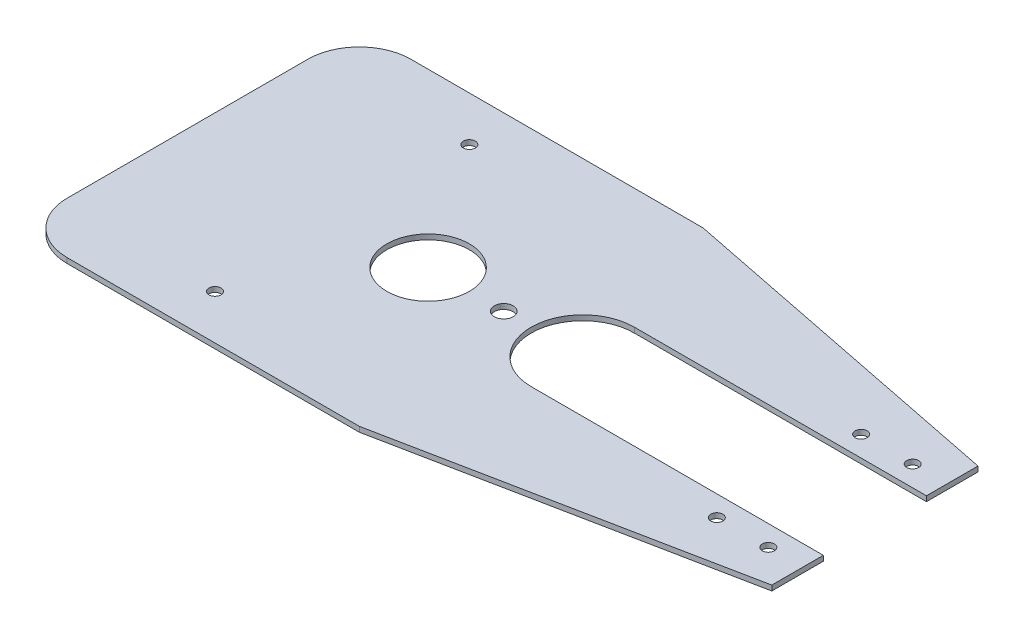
from build123d import *

# Parameters (mm, degrees)
SKETCH1_R      = 12
SKETCH1_R_2    = 2.75
SKETCH1_R_3    = 1.75
EXTRUDE1_DEPTH = 1.5


with BuildPart() as part:
    # Sketch1 → Extrude1 (new body)
    with BuildSketch(Plane(origin=(0, 0, 0), x_dir=(1, 0, 0), z_dir=(0, 1, 0))):
        with BuildLine():
            Line((15, 0), (100, 0))
            Line((100, 0), (200, 20))
            Line((200, 20), (200, 35))
            Line((200, 35), (115, 35))
            ThreePointArc((115, 35), (100, 50), (115, 65))
            Line((115, 65), (200, 65))
            Line((200, 65), (200, 80))
            Line((200, 80), (100, 100))
            Line((100, 100), (15, 100))
            ThreePointArc((15, 100), (4.393398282, 95.606601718), (0, 85))
            Line((0, 85), (0, 15))
            ThreePointArc((0, 15), (4.393398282, 4.393398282), (15, 0))
        make_face()
        with Locations(Location((70, 50, 0), (0, 0, 270))):
            Circle(SKETCH1_R, mode=Mode.SUBTRACT)
        with Locations(Location((92, 50, 0), (0, 0, 270))):
            Circle(SKETCH1_R_2, mode=Mode.SUBTRACT)
        with Locations(Location((190, 71, 0), (0, 0, 270))):
            Circle(SKETCH1_R_3, mode=Mode.SUBTRACT)
        with Locations(Location((175, 71, 0), (0, 0, 270))):
            Circle(SKETCH1_R_3, mode=Mode.SUBTRACT)
        with Locations(Location((175, 29, 0), (0, 0, 270))):
            Circle(SKETCH1_R_3, mode=Mode.SUBTRACT)
        with Locations(Location((190, 29, 0), (0, 0, 270))):
            Circle(SKETCH1_R_3, mode=Mode.SUBTRACT)
        with Locations(Location((45, 87, 0), (0, 0, 270))):
            Circle(SKETCH1_R_3, mode=Mode.SUBTRACT)
        with Locations(Location((45, 13, 0), (0, 0, 270))):
            Circle(SKETCH1_R_3, mode=Mode.SUBTRACT)
    extrude(amount=EXTRUDE1_DEPTH)


solid = part.part
